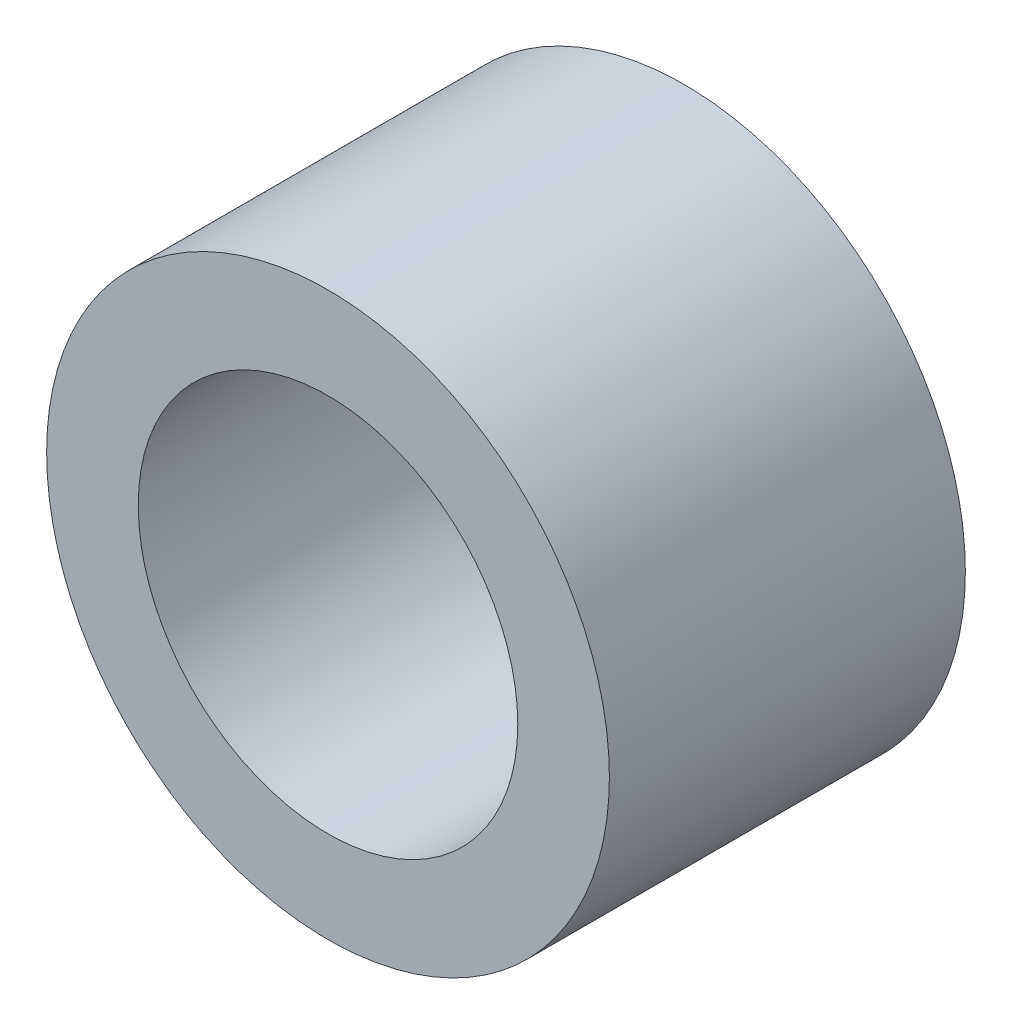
ISO-10303-21;
HEADER;
FILE_DESCRIPTION(('STEP AP214'),'2;1');
FILE_NAME('part.step','',(''),(''),'','','');
FILE_SCHEMA(('AUTOMOTIVE_DESIGN { 1 0 10303 214 1 1 1 1 }'));
ENDSEC;
DATA;
#1=APPLICATION_CONTEXT('core data for automotive mechanical design processes');
#2=APPLICATION_PROTOCOL_DEFINITION('international standard','automotive_design',2000,#1);
#3=PRODUCT_CONTEXT('',#1,'mechanical');
#4=PRODUCT('Part','Part','',(#3));
#5=PRODUCT_RELATED_PRODUCT_CATEGORY('part','',(#4));
#6=PRODUCT_DEFINITION_FORMATION('','',#4);
#7=PRODUCT_DEFINITION_CONTEXT('part definition',#1,'design');
#8=PRODUCT_DEFINITION('design','',#6,#7);
#9=PRODUCT_DEFINITION_SHAPE('','',#8);
#10=(LENGTH_UNIT() NAMED_UNIT(*) SI_UNIT(.MILLI.,.METRE.));
#11=(NAMED_UNIT(*) PLANE_ANGLE_UNIT() SI_UNIT($,.RADIAN.));
#12=(NAMED_UNIT(*) SI_UNIT($,.STERADIAN.) SOLID_ANGLE_UNIT());
#13=UNCERTAINTY_MEASURE_WITH_UNIT(LENGTH_MEASURE(1.E-05),#10,'distance_accuracy_value','');
#14=(GEOMETRIC_REPRESENTATION_CONTEXT(3) GLOBAL_UNCERTAINTY_ASSIGNED_CONTEXT((#13)) GLOBAL_UNIT_ASSIGNED_CONTEXT((#10,
#11,#12)) REPRESENTATION_CONTEXT('',''));
#15=CARTESIAN_POINT('',(0.,0.,0.));
#16=DIRECTION('',(0.,0.,1.));
#17=DIRECTION('',(1.,0.,0.));
#18=AXIS2_PLACEMENT_3D('',#15,#16,#17);
#19=CARTESIAN_POINT('',(0.,0.,-13.6));
#20=DIRECTION('',(0.,0.,1.));
#21=DIRECTION('',(1.,0.,0.));
#22=AXIS2_PLACEMENT_3D('',#19,#20,#21);
#23=CYLINDRICAL_SURFACE('',#22,7.25);
#24=CARTESIAN_POINT('',(0.,0.,0.));
#25=DIRECTION('',(0.,0.,1.));
#26=DIRECTION('',(1.,0.,0.));
#27=AXIS2_PLACEMENT_3D('',#24,#25,#26);
#28=CIRCLE('',#27,7.25);
#29=CARTESIAN_POINT('',(7.25,0.,0.));
#30=VERTEX_POINT('',#29);
#31=EDGE_CURVE('E34',#30,#30,#28,.F.);
#32=ORIENTED_EDGE('',*,*,#31,.F.);
#33=EDGE_LOOP('',(#32));
#34=FACE_BOUND('',#33,.T.);
#35=CARTESIAN_POINT('',(0.,0.,-13.6));
#36=DIRECTION('',(0.,0.,1.));
#37=DIRECTION('',(1.,0.,0.));
#38=AXIS2_PLACEMENT_3D('',#35,#36,#37);
#39=CIRCLE('',#38,7.25);
#40=CARTESIAN_POINT('',(7.25,0.,-13.6));
#41=VERTEX_POINT('',#40);
#42=EDGE_CURVE('E25',#41,#41,#39,.F.);
#43=ORIENTED_EDGE('',*,*,#42,.T.);
#44=EDGE_LOOP('',(#43));
#45=FACE_BOUND('',#44,.T.);
#46=ADVANCED_FACE('F22',(#34,#45),#23,.F.);
#47=CARTESIAN_POINT('',(0.,0.,-13.6));
#48=DIRECTION('',(0.,0.,1.));
#49=DIRECTION('',(1.,0.,0.));
#50=AXIS2_PLACEMENT_3D('',#47,#48,#49);
#51=PLANE('',#50);
#52=CARTESIAN_POINT('',(0.,0.,-13.6));
#53=DIRECTION('',(0.,0.,1.));
#54=DIRECTION('',(1.,0.,0.));
#55=AXIS2_PLACEMENT_3D('',#52,#53,#54);
#56=CIRCLE('',#55,10.75);
#57=CARTESIAN_POINT('',(10.75,0.,-13.6));
#58=VERTEX_POINT('',#57);
#59=EDGE_CURVE('E29',#58,#58,#56,.T.);
#60=ORIENTED_EDGE('',*,*,#59,.F.);
#61=EDGE_LOOP('',(#60));
#62=FACE_BOUND('',#61,.T.);
#63=ORIENTED_EDGE('',*,*,#42,.F.);
#64=EDGE_LOOP('',(#63));
#65=FACE_BOUND('',#64,.T.);
#66=ADVANCED_FACE('F43',(#62,#65),#51,.F.);
#67=CARTESIAN_POINT('',(0.,0.,0.));
#68=DIRECTION('',(0.,0.,1.));
#69=DIRECTION('',(1.,0.,0.));
#70=AXIS2_PLACEMENT_3D('',#67,#68,#69);
#71=PLANE('',#70);
#72=CARTESIAN_POINT('',(0.,0.,0.));
#73=DIRECTION('',(0.,0.,1.));
#74=DIRECTION('',(1.,0.,0.));
#75=AXIS2_PLACEMENT_3D('',#72,#73,#74);
#76=CIRCLE('',#75,10.75);
#77=CARTESIAN_POINT('',(10.75,0.,0.));
#78=VERTEX_POINT('',#77);
#79=EDGE_CURVE('E12',#78,#78,#76,.F.);
#80=ORIENTED_EDGE('',*,*,#79,.F.);
#81=EDGE_LOOP('',(#80));
#82=FACE_BOUND('',#81,.T.);
#83=ORIENTED_EDGE('',*,*,#31,.T.);
#84=EDGE_LOOP('',(#83));
#85=FACE_BOUND('',#84,.T.);
#86=ADVANCED_FACE('F45',(#82,#85),#71,.T.);
#87=CARTESIAN_POINT('',(0.,0.,-13.6));
#88=DIRECTION('',(0.,0.,1.));
#89=DIRECTION('',(1.,0.,0.));
#90=AXIS2_PLACEMENT_3D('',#87,#88,#89);
#91=CYLINDRICAL_SURFACE('',#90,10.75);
#92=ORIENTED_EDGE('',*,*,#79,.T.);
#93=EDGE_LOOP('',(#92));
#94=FACE_BOUND('',#93,.T.);
#95=ORIENTED_EDGE('',*,*,#59,.T.);
#96=EDGE_LOOP('',(#95));
#97=FACE_BOUND('',#96,.T.);
#98=ADVANCED_FACE('F52',(#94,#97),#91,.T.);
#99=CLOSED_SHELL('',(#46,#66,#86,#98));
#100=MANIFOLD_SOLID_BREP('B1',#99);
#101=ADVANCED_BREP_SHAPE_REPRESENTATION('',(#18,#100),#14);
#102=SHAPE_DEFINITION_REPRESENTATION(#9,#101);
ENDSEC;
END-ISO-10303-21;
